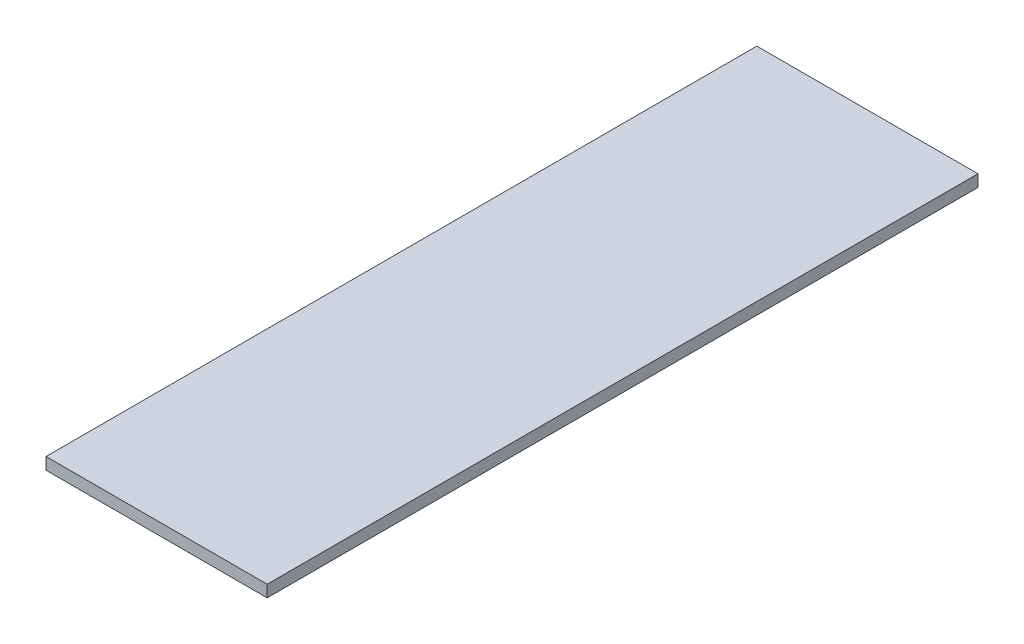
ISO-10303-21;
HEADER;
FILE_DESCRIPTION(('STEP AP214'),'2;1');
FILE_NAME('part.step','',(''),(''),'','','');
FILE_SCHEMA(('AUTOMOTIVE_DESIGN { 1 0 10303 214 1 1 1 1 }'));
ENDSEC;
DATA;
#1=APPLICATION_CONTEXT('core data for automotive mechanical design processes');
#2=APPLICATION_PROTOCOL_DEFINITION('international standard','automotive_design',2000,#1);
#3=PRODUCT_CONTEXT('',#1,'mechanical');
#4=PRODUCT('Part','Part','',(#3));
#5=PRODUCT_RELATED_PRODUCT_CATEGORY('part','',(#4));
#6=PRODUCT_DEFINITION_FORMATION('','',#4);
#7=PRODUCT_DEFINITION_CONTEXT('part definition',#1,'design');
#8=PRODUCT_DEFINITION('design','',#6,#7);
#9=PRODUCT_DEFINITION_SHAPE('','',#8);
#10=(LENGTH_UNIT() NAMED_UNIT(*) SI_UNIT(.MILLI.,.METRE.));
#11=(NAMED_UNIT(*) PLANE_ANGLE_UNIT() SI_UNIT($,.RADIAN.));
#12=(NAMED_UNIT(*) SI_UNIT($,.STERADIAN.) SOLID_ANGLE_UNIT());
#13=UNCERTAINTY_MEASURE_WITH_UNIT(LENGTH_MEASURE(1.E-05),#10,'distance_accuracy_value','');
#14=(GEOMETRIC_REPRESENTATION_CONTEXT(3) GLOBAL_UNCERTAINTY_ASSIGNED_CONTEXT((#13)) GLOBAL_UNIT_ASSIGNED_CONTEXT((#10,
#11,#12)) REPRESENTATION_CONTEXT('',''));
#15=CARTESIAN_POINT('',(0.,0.,0.));
#16=DIRECTION('',(0.,0.,1.));
#17=DIRECTION('',(1.,0.,0.));
#18=AXIS2_PLACEMENT_3D('',#15,#16,#17);
#19=CARTESIAN_POINT('',(44.45,4.7625,-142.875));
#20=DIRECTION('',(-1.,0.,0.));
#21=DIRECTION('',(0.,0.,1.));
#22=AXIS2_PLACEMENT_3D('',#19,#20,#21);
#23=PLANE('',#22);
#24=DIRECTION('',(0.,0.,-1.));
#25=VECTOR('',#24,1.);
#26=CARTESIAN_POINT('',(44.45,0.,-142.875));
#27=LINE('',#26,#25);
#28=CARTESIAN_POINT('',(44.45,0.,142.875));
#29=VERTEX_POINT('',#28);
#30=CARTESIAN_POINT('',(44.45,0.,-142.875));
#31=VERTEX_POINT('',#30);
#32=EDGE_CURVE('E96',#29,#31,#27,.T.);
#33=ORIENTED_EDGE('',*,*,#32,.T.);
#34=DIRECTION('',(0.,-1.,0.));
#35=VECTOR('',#34,1.);
#36=CARTESIAN_POINT('',(44.45,4.7625,-142.875));
#37=LINE('',#36,#35);
#38=CARTESIAN_POINT('',(44.45,4.7625,-142.875));
#39=VERTEX_POINT('',#38);
#40=EDGE_CURVE('E11',#39,#31,#37,.T.);
#41=ORIENTED_EDGE('',*,*,#40,.F.);
#42=DIRECTION('',(0.,0.,-1.));
#43=VECTOR('',#42,1.);
#44=CARTESIAN_POINT('',(44.45,4.7625,-142.875));
#45=LINE('',#44,#43);
#46=CARTESIAN_POINT('',(44.45,4.7625,142.875));
#47=VERTEX_POINT('',#46);
#48=EDGE_CURVE('E84',#47,#39,#45,.T.);
#49=ORIENTED_EDGE('',*,*,#48,.F.);
#50=DIRECTION('',(0.,-1.,0.));
#51=VECTOR('',#50,1.);
#52=CARTESIAN_POINT('',(44.45,4.7625,142.875));
#53=LINE('',#52,#51);
#54=EDGE_CURVE('E92',#47,#29,#53,.T.);
#55=ORIENTED_EDGE('',*,*,#54,.T.);
#56=EDGE_LOOP('',(#33,#41,#49,#55));
#57=FACE_BOUND('',#56,.T.);
#58=ADVANCED_FACE('F33',(#57),#23,.F.);
#59=CARTESIAN_POINT('',(-44.45,4.7625,-142.875));
#60=DIRECTION('',(0.,0.,1.));
#61=DIRECTION('',(1.,0.,0.));
#62=AXIS2_PLACEMENT_3D('',#59,#60,#61);
#63=PLANE('',#62);
#64=DIRECTION('',(-1.,0.,0.));
#65=VECTOR('',#64,1.);
#66=CARTESIAN_POINT('',(-44.45,0.,-142.875));
#67=LINE('',#66,#65);
#68=CARTESIAN_POINT('',(-44.45,0.,-142.875));
#69=VERTEX_POINT('',#68);
#70=EDGE_CURVE('E88',#31,#69,#67,.T.);
#71=ORIENTED_EDGE('',*,*,#70,.T.);
#72=DIRECTION('',(0.,-1.,0.));
#73=VECTOR('',#72,1.);
#74=CARTESIAN_POINT('',(-44.45,4.7625,-142.875));
#75=LINE('',#74,#73);
#76=CARTESIAN_POINT('',(-44.45,4.7625,-142.875));
#77=VERTEX_POINT('',#76);
#78=EDGE_CURVE('E41',#77,#69,#75,.T.);
#79=ORIENTED_EDGE('',*,*,#78,.F.);
#80=DIRECTION('',(-1.,0.,0.));
#81=VECTOR('',#80,1.);
#82=CARTESIAN_POINT('',(-44.45,4.7625,-142.875));
#83=LINE('',#82,#81);
#84=EDGE_CURVE('E79',#39,#77,#83,.T.);
#85=ORIENTED_EDGE('',*,*,#84,.F.);
#86=ORIENTED_EDGE('',*,*,#40,.T.);
#87=EDGE_LOOP('',(#71,#79,#85,#86));
#88=FACE_BOUND('',#87,.T.);
#89=ADVANCED_FACE('F87',(#88),#63,.F.);
#90=CARTESIAN_POINT('',(-44.45,4.7625,-142.875));
#91=DIRECTION('',(1.,0.,0.));
#92=DIRECTION('',(0.,0.,-1.));
#93=AXIS2_PLACEMENT_3D('',#90,#91,#92);
#94=PLANE('',#93);
#95=DIRECTION('',(0.,0.,1.));
#96=VECTOR('',#95,1.);
#97=CARTESIAN_POINT('',(-44.45,0.,-142.875));
#98=LINE('',#97,#96);
#99=CARTESIAN_POINT('',(-44.45,0.,142.875));
#100=VERTEX_POINT('',#99);
#101=EDGE_CURVE('E66',#69,#100,#98,.T.);
#102=ORIENTED_EDGE('',*,*,#101,.T.);
#103=DIRECTION('',(0.,-1.,0.));
#104=VECTOR('',#103,1.);
#105=CARTESIAN_POINT('',(-44.45,4.7625,142.875));
#106=LINE('',#105,#104);
#107=CARTESIAN_POINT('',(-44.45,4.7625,142.875));
#108=VERTEX_POINT('',#107);
#109=EDGE_CURVE('E89',#108,#100,#106,.T.);
#110=ORIENTED_EDGE('',*,*,#109,.F.);
#111=DIRECTION('',(0.,0.,1.));
#112=VECTOR('',#111,1.);
#113=CARTESIAN_POINT('',(-44.45,4.7625,-142.875));
#114=LINE('',#113,#112);
#115=EDGE_CURVE('E82',#77,#108,#114,.T.);
#116=ORIENTED_EDGE('',*,*,#115,.F.);
#117=ORIENTED_EDGE('',*,*,#78,.T.);
#118=EDGE_LOOP('',(#102,#110,#116,#117));
#119=FACE_BOUND('',#118,.T.);
#120=ADVANCED_FACE('F90',(#119),#94,.F.);
#121=CARTESIAN_POINT('',(-44.45,4.7625,142.875));
#122=DIRECTION('',(0.,0.,-1.));
#123=DIRECTION('',(-1.,0.,0.));
#124=AXIS2_PLACEMENT_3D('',#121,#122,#123);
#125=PLANE('',#124);
#126=DIRECTION('',(1.,0.,0.));
#127=VECTOR('',#126,1.);
#128=CARTESIAN_POINT('',(-44.45,0.,142.875));
#129=LINE('',#128,#127);
#130=EDGE_CURVE('E72',#100,#29,#129,.T.);
#131=ORIENTED_EDGE('',*,*,#130,.T.);
#132=ORIENTED_EDGE('',*,*,#54,.F.);
#133=DIRECTION('',(1.,0.,0.));
#134=VECTOR('',#133,1.);
#135=CARTESIAN_POINT('',(-44.45,4.7625,142.875));
#136=LINE('',#135,#134);
#137=EDGE_CURVE('E49',#108,#47,#136,.T.);
#138=ORIENTED_EDGE('',*,*,#137,.F.);
#139=ORIENTED_EDGE('',*,*,#109,.T.);
#140=EDGE_LOOP('',(#131,#132,#138,#139));
#141=FACE_BOUND('',#140,.T.);
#142=ADVANCED_FACE('F103',(#141),#125,.F.);
#143=CARTESIAN_POINT('',(0.,4.7625,0.));
#144=DIRECTION('',(0.,1.,0.));
#145=DIRECTION('',(0.,0.,1.));
#146=AXIS2_PLACEMENT_3D('',#143,#144,#145);
#147=PLANE('',#146);
#148=ORIENTED_EDGE('',*,*,#48,.T.);
#149=ORIENTED_EDGE('',*,*,#84,.T.);
#150=ORIENTED_EDGE('',*,*,#115,.T.);
#151=ORIENTED_EDGE('',*,*,#137,.T.);
#152=EDGE_LOOP('',(#148,#149,#150,#151));
#153=FACE_BOUND('',#152,.T.);
#154=ADVANCED_FACE('F80',(#153),#147,.T.);
#155=CARTESIAN_POINT('',(0.,0.,0.));
#156=DIRECTION('',(0.,1.,0.));
#157=DIRECTION('',(0.,0.,1.));
#158=AXIS2_PLACEMENT_3D('',#155,#156,#157);
#159=PLANE('',#158);
#160=ORIENTED_EDGE('',*,*,#32,.F.);
#161=ORIENTED_EDGE('',*,*,#130,.F.);
#162=ORIENTED_EDGE('',*,*,#101,.F.);
#163=ORIENTED_EDGE('',*,*,#70,.F.);
#164=EDGE_LOOP('',(#160,#161,#162,#163));
#165=FACE_BOUND('',#164,.T.);
#166=ADVANCED_FACE('F106',(#165),#159,.F.);
#167=CLOSED_SHELL('',(#58,#89,#120,#142,#154,#166));
#168=MANIFOLD_SOLID_BREP('B2',#167);
#169=ADVANCED_BREP_SHAPE_REPRESENTATION('',(#18,#168),#14);
#170=SHAPE_DEFINITION_REPRESENTATION(#9,#169);
ENDSEC;
END-ISO-10303-21;
